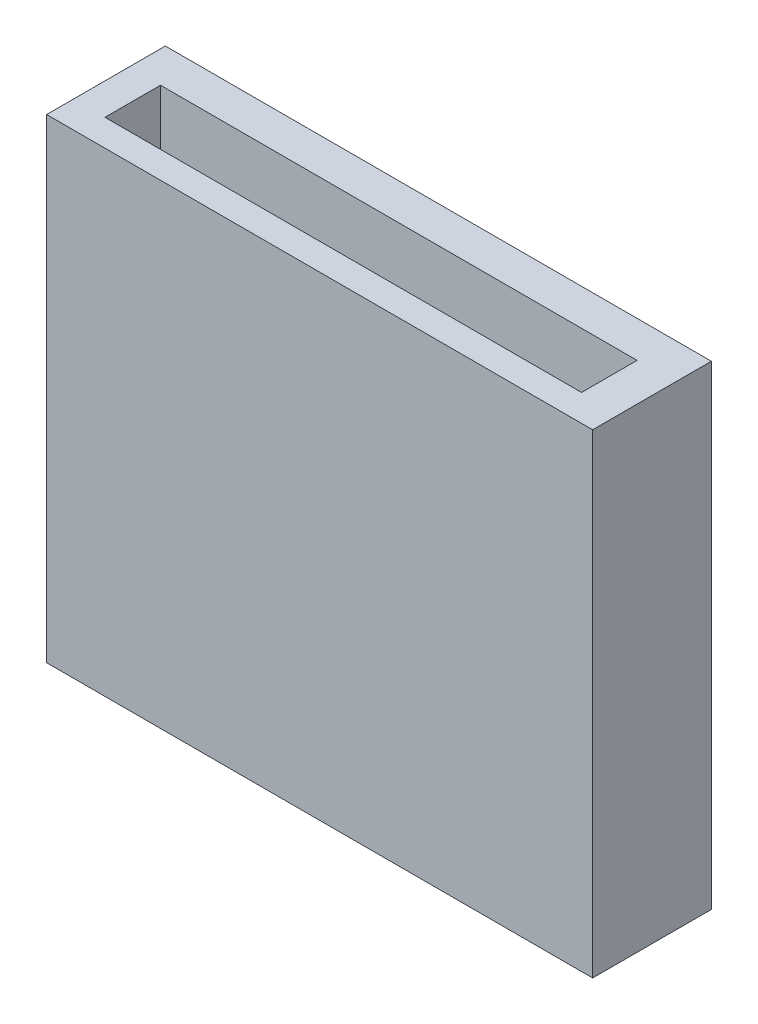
from build123d import *

# Parameters (mm, degrees)
SKETCH1_W           = 46
SKETCH1_H           = 10
BOSS_EXTRUDE1_DEPTH = 40
SKETCH3_W           = 40.15
SKETCH3_H           = 4.68
CUT_EXTRUDE1_DEPTH  = 40


with BuildPart() as part:
    # Sketch1 → Boss-Extrude1 (new body)
    with BuildSketch(Plane(origin=(0, 0, 0), x_dir=(1, 0, 0), z_dir=(0, 1, 0))):
        with Locations((23, 5)):
            Rectangle(SKETCH1_W, SKETCH1_H)
    extrude(amount=BOSS_EXTRUDE1_DEPTH)

    # Sketch3 → Cut-Extrude1 (cut)
    with BuildSketch(Plane(origin=(0, 40, 0), x_dir=(1, 0, 0), z_dir=(0, 1, 0))):
        with Locations((22.732429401, 4.594629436)):
            Rectangle(SKETCH3_W, SKETCH3_H)
    extrude(amount=-CUT_EXTRUDE1_DEPTH, mode=Mode.SUBTRACT)


solid = part.part
